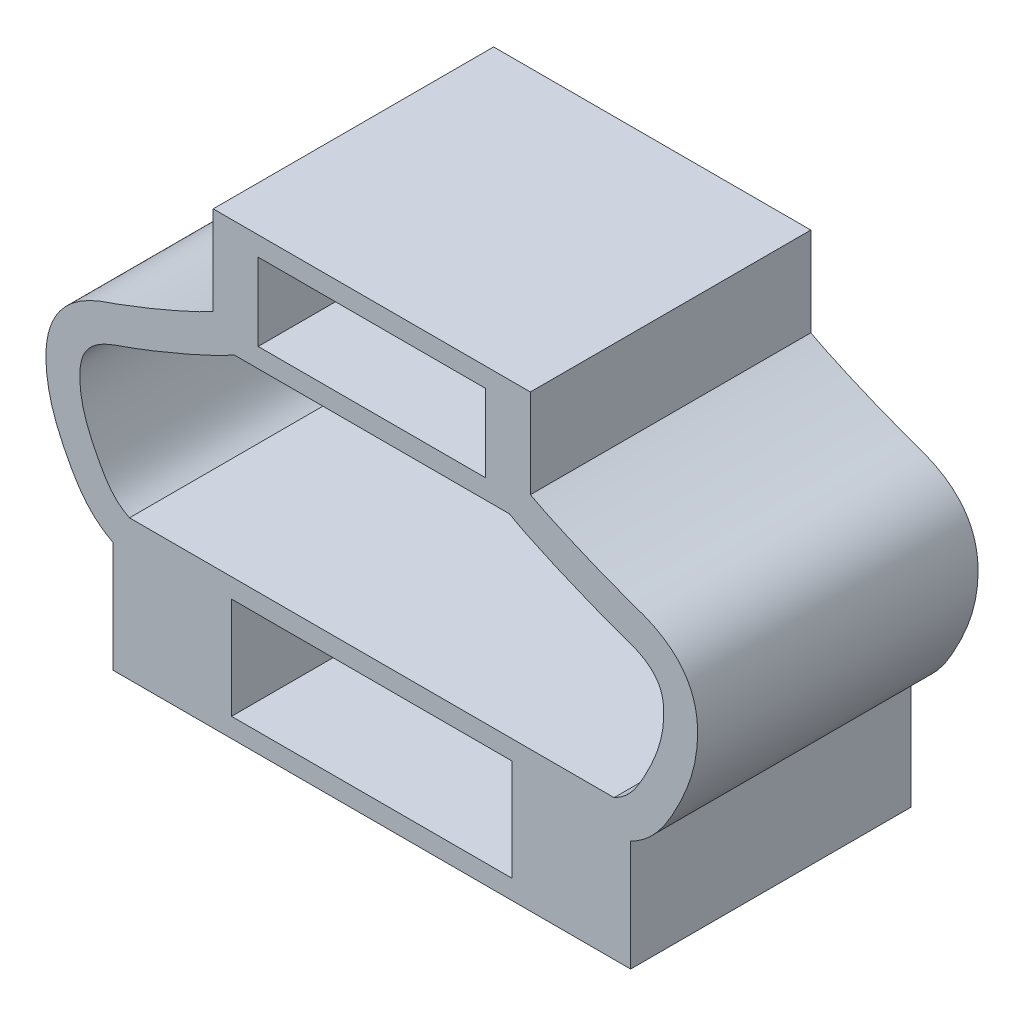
from build123d import *

# Parameters (mm, degrees)
EXTRUDE_1_DEPTH = 5.8


with BuildPart() as part:
    # Model → Extrude 1 (new body)
    with BuildSketch(Plane.XY):
        with BuildLine():
            Line((5.011290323, 0), (0, 0))
            add(Edge.make_bspline(
                [(0, 0), (-0.035665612, 0.01897476), (-0.071331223, 0.03794952), (-0.105594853, 0.059263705), (-0.134579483, 0.077294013), (-0.162560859, 0.096998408), (-0.189547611, 0.117952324), (-0.213832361, 0.136808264), (-0.237311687, 0.156676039), (-0.259879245, 0.177534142), (-0.281164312, 0.197206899), (-0.301638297, 0.217760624), (-0.321343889, 0.23901886), (-0.340594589, 0.259786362), (-0.359111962, 0.281226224), (-0.376972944, 0.303196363), (-0.394883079, 0.325226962), (-0.412133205, 0.34779076), (-0.42882527, 0.37075697), (-0.445892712, 0.394239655), (-0.462376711, 0.418143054), (-0.478383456, 0.442359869), (-0.494994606, 0.467491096), (-0.511091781, 0.492959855), (-0.526778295, 0.518677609), (-0.543247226, 0.545678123), (-0.559263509, 0.57295309), (-0.57492421, 0.600429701), (-0.591521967, 0.62955037), (-0.607720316, 0.658897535), (-0.623606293, 0.688412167), (-0.640578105, 0.719944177), (-0.657193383, 0.751667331), (-0.673540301, 0.78352727), (-0.691128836, 0.817807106), (-0.708406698, 0.852245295), (-0.725417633, 0.886816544), (-0.743154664, 0.922863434), (-0.760601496, 0.959054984), (-0.777433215, 0.995532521), (-0.793526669, 1.030410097), (-0.809057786, 1.065549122), (-0.824004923, 1.100934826), (-0.838299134, 1.134774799), (-0.85205927, 1.168840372), (-0.865202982, 1.203143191), (-0.877830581, 1.236099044), (-0.889889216, 1.269273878), (-0.901316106, 1.302665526), (-0.912347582, 1.3349017), (-0.922790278, 1.367339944), (-0.932582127, 1.399974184), (-0.942083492, 1.431640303), (-0.950972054, 1.463490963), (-0.959192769, 1.495513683), (-0.967212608, 1.526753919), (-0.97459684, 1.558157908), (-0.9812973, 1.589707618), (-0.987871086, 1.620660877), (-0.99378671, 1.651754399), (-0.999005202, 1.682964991), (-1.00415543, 1.713767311), (-1.008626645, 1.744683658), (-1.012387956, 1.775686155), (-1.016123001, 1.806472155), (-1.019158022, 1.837343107), (-1.021480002, 1.86826856), (-1.023800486, 1.899174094), (-1.025408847, 1.930134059), (-1.026278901, 1.961112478), (-1.02715408, 1.992273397), (-1.027282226, 2.023452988), (-1.026744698, 2.054626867), (-1.026205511, 2.085896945), (-1.024996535, 2.117161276), (-1.022511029, 2.148335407), (-1.020135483, 2.178130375), (-1.016593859, 2.207842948), (-1.011693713, 2.237334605), (-1.007001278, 2.265576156), (-1.001063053, 2.293615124), (-0.993697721, 2.321281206), (-0.986540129, 2.348166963), (-0.978034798, 2.374700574), (-0.968075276, 2.400681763), (-0.958218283, 2.426395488), (-0.946936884, 2.451568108), (-0.934218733, 2.475995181), (-0.921357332, 2.500697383), (-0.907026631, 2.524637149), (-0.891328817, 2.547642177), (-0.875070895, 2.57146804), (-0.857346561, 2.59429127), (-0.838370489, 2.616014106), (-0.818226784, 2.639073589), (-0.796672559, 2.660893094), (-0.774011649, 2.681481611), (-0.749375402, 2.703864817), (-0.723431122, 2.724793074), (-0.696537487, 2.744403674), (-0.666650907, 2.766196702), (-0.63559191, 2.786362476), (-0.603729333, 2.805137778), (-0.567619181, 2.826416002), (-0.530476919, 2.845908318), (-0.492690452, 2.86405222), (-0.449106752, 2.884979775), (-0.404666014, 2.904113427), (-0.359590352, 2.921542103), (-0.306664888, 2.942005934), (-0.252864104, 2.960119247), (-0.199193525, 2.978572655), (-0.134390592, 3.000853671), (-0.06977748, 3.023630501), (-0.005355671, 3.046948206), (0.069926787, 3.074196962), (0.144948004, 3.102184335), (0.219783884, 3.13065165), (0.303039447, 3.162321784), (0.386065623, 3.194585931), (0.468886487, 3.22737005), (0.55662295, 3.262099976), (0.644129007, 3.297413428), (0.731418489, 3.333253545), (0.81950148, 3.369419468), (0.90736394, 3.406121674), (0.994995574, 3.443367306), (1.079308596, 3.479202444), (1.163407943, 3.515540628), (1.247264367, 3.552432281), (1.324316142, 3.586330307), (1.401162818, 3.620695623), (1.477748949, 3.655632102), (1.545093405, 3.686352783), (1.612236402, 3.7175151), (1.679114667, 3.749241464), (1.735503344, 3.775991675), (1.791703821, 3.803142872), (1.847586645, 3.830928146), (1.892816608, 3.853416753), (1.937838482, 3.876320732), (1.982609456, 3.899725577), (2.01736917, 3.917896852), (2.051977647, 3.93637004), (2.086052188, 3.955779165), (2.111327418, 3.970176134), (2.13630887, 3.985088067), (2.161290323, 4)],
                knots=[0, 0, 0, 0, 0.121088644, 0.121088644, 0.121088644, 0.223521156, 0.223521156, 0.223521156, 0.31569779, 0.31569779, 0.31569779, 0.402636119, 0.402636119, 0.402636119, 0.487567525, 0.487567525, 0.487567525, 0.572732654, 0.572732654, 0.572732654, 0.659813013, 0.659813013, 0.659813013, 0.75018147, 0.75018147, 0.75018147, 0.845057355, 0.845057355, 0.845057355, 0.945610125, 0.945610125, 0.945610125, 1.053035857, 1.053035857, 1.053035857, 1.168621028, 1.168621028, 1.168621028, 1.289139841, 1.289139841, 1.289139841, 1.404372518, 1.404372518, 1.404372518, 1.514571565, 1.514571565, 1.514571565, 1.620443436, 1.620443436, 1.620443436, 1.722651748, 1.722651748, 1.722651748, 1.821827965, 1.821827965, 1.821827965, 1.918580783, 1.918580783, 1.918580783, 2.013504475, 2.013504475, 2.013504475, 2.107186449, 2.107186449, 2.107186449, 2.200214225, 2.200214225, 2.200214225, 2.293182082, 2.293182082, 2.293182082, 2.386697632, 2.386697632, 2.386697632, 2.480501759, 2.480501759, 2.480501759, 2.570155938, 2.570155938, 2.570155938, 2.65600981, 2.65600981, 2.65600981, 2.739442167, 2.739442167, 2.739442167, 2.822015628, 2.822015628, 2.822015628, 2.905519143, 2.905519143, 2.905519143, 2.992002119, 2.992002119, 2.992002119, 3.083806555, 3.083806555, 3.083806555, 3.183613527, 3.183613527, 3.183613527, 3.294527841, 3.294527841, 3.294527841, 3.420228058, 3.420228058, 3.420228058, 3.56521331, 3.56521331, 3.56521331, 3.735447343, 3.735447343, 3.735447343, 3.940991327, 3.940991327, 3.940991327, 4.18118726, 4.18118726, 4.18118726, 4.448407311, 4.448407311, 4.448407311, 4.731487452, 4.731487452, 4.731487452, 5.017140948, 5.017140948, 5.017140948, 5.291976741, 5.291976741, 5.291976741, 5.544510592, 5.544510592, 5.544510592, 5.766571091, 5.766571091, 5.766571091, 5.953802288, 5.953802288, 5.953802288, 6.105341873, 6.105341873, 6.105341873, 6.222995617, 6.222995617, 6.222995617, 6.310266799, 6.310266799, 6.310266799, 6.310266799], degree=3))
            Line((2.161290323, 4), (5.011290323, 4))
            Line((5.011290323, 4), (5.011290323, 4.4))
            Line((5.011290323, 4.4), (2.661290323, 4.4))
            Line((2.661290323, 4.4), (2.661290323, 6))
            Line((2.661290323, 6), (5.011290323, 6))
            Line((5.011290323, 6), (5.011290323, 6.4))
            Line((5.011290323, 6.4), (1.73135796, 6.4))
            Line((1.73135796, 6.4), (1.73135796, 4.559262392))
            add(Edge.make_bspline(
                [(1.73135796, 4.559262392), (1.704001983, 4.544452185), (1.676646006, 4.529641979), (1.649109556, 4.515174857), (1.609629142, 4.494432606), (1.56977774, 4.474395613), (1.529793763, 4.454632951), (1.4779766, 4.429021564), (1.425936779, 4.403870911), (1.373713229, 4.379106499), (1.310271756, 4.349022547), (1.246559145, 4.319508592), (1.182664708, 4.290396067), (1.109071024, 4.256864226), (1.03523612, 4.223864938), (0.961204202, 4.191313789), (0.880098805, 4.155652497), (0.798756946, 4.120529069), (0.717209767, 4.085889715), (0.632220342, 4.049788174), (0.547007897, 4.014212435), (0.461582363, 3.979154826), (0.376956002, 3.944425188), (0.29212052, 3.910204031), (0.207057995, 3.876558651), (0.127051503, 3.84491312), (0.046844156, 3.813776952), (-0.033576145, 3.783191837), (-0.105273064, 3.755924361), (-0.177139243, 3.729094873), (-0.249291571, 3.703069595), (-0.310046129, 3.681155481), (-0.371003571, 3.659811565), (-0.432053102, 3.638706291), (-0.486240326, 3.619973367), (-0.5405001, 3.601428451), (-0.594099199, 3.581091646), (-0.653697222, 3.558478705), (-0.712478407, 3.533650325), (-0.77025605, 3.506669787), (-0.825157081, 3.481032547), (-0.879152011, 3.453452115), (-0.93181237, 3.423491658), (-0.982530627, 3.394636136), (-1.032010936, 3.363572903), (-1.079841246, 3.330132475), (-1.126733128, 3.297348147), (-1.172039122, 3.26227899), (-1.215317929, 3.224849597), (-1.258192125, 3.187770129), (-1.29907686, 3.14837435), (-1.337553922, 3.106744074), (-1.375774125, 3.065391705), (-1.411618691, 3.021834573), (-1.444736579, 2.976291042), (-1.477517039, 2.93121154), (-1.507626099, 2.88418591), (-1.534826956, 2.835536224), (-1.561571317, 2.787702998), (-1.585504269, 2.73829977), (-1.606529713, 2.687693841), (-1.627074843, 2.638243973), (-1.644843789, 2.587645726), (-1.659870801, 2.53625429), (-1.674513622, 2.486176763), (-1.686552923, 2.435346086), (-1.69614298, 2.38406293), (-1.705506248, 2.333992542), (-1.712534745, 2.283490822), (-1.717397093, 2.232794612), (-1.722070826, 2.184064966), (-1.724743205, 2.135155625), (-1.726031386, 2.086220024), (-1.727159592, 2.043361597), (-1.727226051, 2.000483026), (-1.726270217, 1.957625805), (-1.725336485, 1.915759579), (-1.723427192, 1.873913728), (-1.720546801, 1.832135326), (-1.717671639, 1.790432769), (-1.713828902, 1.748797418), (-1.709036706, 1.707271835), (-1.704240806, 1.665714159), (-1.698493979, 1.62426642), (-1.69182594, 1.582967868), (-1.685134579, 1.541524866), (-1.677515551, 1.500232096), (-1.669009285, 1.459123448), (-1.660448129, 1.417749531), (-1.650988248, 1.37656212), (-1.64067943, 1.335588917), (-1.630270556, 1.294218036), (-1.618996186, 1.253065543), (-1.606913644, 1.212152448), (-1.594670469, 1.170695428), (-1.581597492, 1.129484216), (-1.567759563, 1.088532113), (-1.553683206, 1.046874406), (-1.53881531, 1.005484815), (-1.523221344, 0.964371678), (-1.507292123, 0.922374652), (-1.490605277, 0.880666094), (-1.473246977, 0.839238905), (-1.455436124, 0.796731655), (-1.43691835, 0.754520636), (-1.417716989, 0.712624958), (-1.398042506, 0.669696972), (-1.377650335, 0.627100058), (-1.35686414, 0.584698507), (-1.337933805, 0.546082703), (-1.318676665, 0.507628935), (-1.299074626, 0.469350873), (-1.280839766, 0.433742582), (-1.26230644, 0.398286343), (-1.243388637, 0.363035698), (-1.225117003, 0.328989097), (-1.206486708, 0.295134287), (-1.187415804, 0.261528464), (-1.168714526, 0.228573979), (-1.149589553, 0.195858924), (-1.129950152, 0.163454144), (-1.110358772, 0.131128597), (-1.090255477, 0.099111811), (-1.069545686, 0.067490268), (-1.048491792, 0.035343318), (-1.02681108, 0.003604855), (-1.004408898, -0.027619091), (-0.981170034, -0.060009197), (-0.957154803, -0.091845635), (-0.932275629, -0.122994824), (-0.905934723, -0.15597413), (-0.878625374, -0.188183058), (-0.850291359, -0.219472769), (-0.819708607, -0.253245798), (-0.787932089, -0.285947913), (-0.754934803, -0.317359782), (-0.718706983, -0.351846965), (-0.68100766, -0.384778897), (-0.642018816, -0.416154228), (-0.598547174, -0.451136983), (-0.553472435, -0.484184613), (-0.506659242, -0.514449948), (-0.453468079, -0.548838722), (-0.398032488, -0.579635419), (-0.342596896, -0.610432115)],
                knots=[-7.690847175, -7.690847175, -7.690847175, -7.690847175, -7.597527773, -7.597527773, -7.597527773, -7.463730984, -7.463730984, -7.463730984, -7.290337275, -7.290337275, -7.290337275, -7.079697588, -7.079697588, -7.079697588, -6.837082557, -6.837082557, -6.837082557, -6.571286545, -6.571286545, -6.571286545, -6.29427083, -6.29427083, -6.29427083, -6.019846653, -6.019846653, -6.019846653, -5.761733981, -5.761733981, -5.761733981, -5.531619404, -5.531619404, -5.531619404, -5.337855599, -5.337855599, -5.337855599, -5.165871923, -5.165871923, -5.165871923, -4.974639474, -4.974639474, -4.974639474, -4.792928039, -4.792928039, -4.792928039, -4.617918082, -4.617918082, -4.617918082, -4.446341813, -4.446341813, -4.446341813, -4.276369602, -4.276369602, -4.276369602, -4.10753206, -4.10753206, -4.10753206, -3.940414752, -3.940414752, -3.940414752, -3.776102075, -3.776102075, -3.776102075, -3.615543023, -3.615543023, -3.615543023, -3.459088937, -3.459088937, -3.459088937, -3.306334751, -3.306334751, -3.306334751, -3.159506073, -3.159506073, -3.159506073, -3.030911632, -3.030911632, -3.030911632, -2.905290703, -2.905290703, -2.905290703, -2.779897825, -2.779897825, -2.779897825, -2.654408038, -2.654408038, -2.654408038, -2.528479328, -2.528479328, -2.528479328, -2.401738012, -2.401738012, -2.401738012, -2.27376657, -2.27376657, -2.27376657, -2.144093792, -2.144093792, -2.144093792, -2.012186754, -2.012186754, -2.012186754, -1.877443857, -1.877443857, -1.877443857, -1.73918804, -1.73918804, -1.73918804, -1.597525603, -1.597525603, -1.597525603, -1.468511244, -1.468511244, -1.468511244, -1.348495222, -1.348495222, -1.348495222, -1.232578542, -1.232578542, -1.232578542, -1.118908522, -1.118908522, -1.118908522, -1.005516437, -1.005516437, -1.005516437, -0.890240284, -0.890240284, -0.890240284, -0.770658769, -0.770658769, -0.770658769, -0.644051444, -0.644051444, -0.644051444, -0.507395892, -0.507395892, -0.507395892, -0.357361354, -0.357361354, -0.357361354, -0.190076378, -0.190076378, -0.190076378, 0, 0, 0, 0], degree=3))
            Line((-0.342596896, -0.610432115), (-0.342596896, -2.9))
            Line((-0.342596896, -2.9), (5.011290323, -2.9))
            Line((5.011290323, -2.9), (5.011290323, -2.5))
            Line((5.011290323, -2.5), (2.111290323, -2.5))
            Line((2.111290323, -2.5), (2.111290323, -0.4))
            Line((2.111290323, -0.4), (5.011290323, -0.4))
            Line((5.011290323, -0.4), (5.011290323, 0))
        make_face()
    extrude_1 = extrude(amount=EXTRUDE_1_DEPTH)

    # Mirror 1: Extrude 1 across plane
    add(extrude_1.mirror(Plane(origin=(5.011290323, 0, 0), x_dir=(0, 0, 1), z_dir=(1, 0, 0))))


solid = part.part
